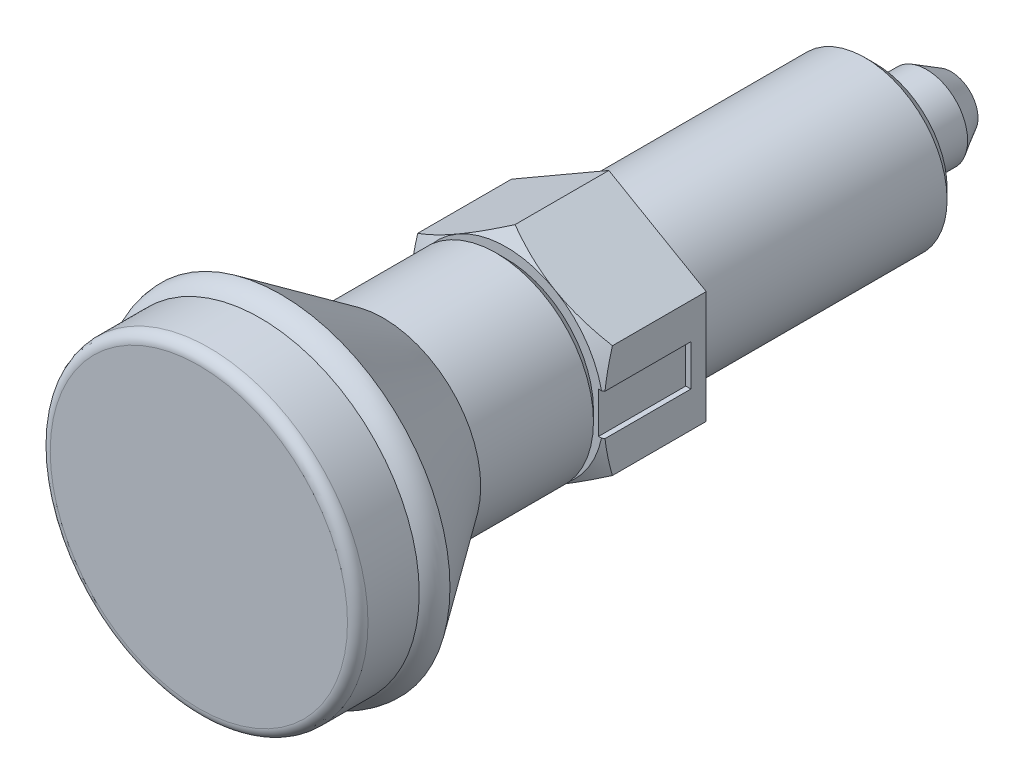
ISO-10303-21;
HEADER;
FILE_DESCRIPTION(('STEP AP214'),'2;1');
FILE_NAME('part.step','',(''),(''),'','','');
FILE_SCHEMA(('AUTOMOTIVE_DESIGN { 1 0 10303 214 1 1 1 1 }'));
ENDSEC;
DATA;
#1=APPLICATION_CONTEXT('core data for automotive mechanical design processes');
#2=APPLICATION_PROTOCOL_DEFINITION('international standard','automotive_design',2000,#1);
#3=PRODUCT_CONTEXT('',#1,'mechanical');
#4=PRODUCT('Part','Part','',(#3));
#5=PRODUCT_RELATED_PRODUCT_CATEGORY('part','',(#4));
#6=PRODUCT_DEFINITION_FORMATION('','',#4);
#7=PRODUCT_DEFINITION_CONTEXT('part definition',#1,'design');
#8=PRODUCT_DEFINITION('design','',#6,#7);
#9=PRODUCT_DEFINITION_SHAPE('','',#8);
#10=(LENGTH_UNIT() NAMED_UNIT(*) SI_UNIT(.MILLI.,.METRE.));
#11=(NAMED_UNIT(*) PLANE_ANGLE_UNIT() SI_UNIT($,.RADIAN.));
#12=(NAMED_UNIT(*) SI_UNIT($,.STERADIAN.) SOLID_ANGLE_UNIT());
#13=UNCERTAINTY_MEASURE_WITH_UNIT(LENGTH_MEASURE(1.E-05),#10,'distance_accuracy_value','');
#14=(GEOMETRIC_REPRESENTATION_CONTEXT(3) GLOBAL_UNCERTAINTY_ASSIGNED_CONTEXT((#13)) GLOBAL_UNIT_ASSIGNED_CONTEXT((#10,
#11,#12)) REPRESENTATION_CONTEXT('',''));
#15=CARTESIAN_POINT('',(0.,0.,0.));
#16=DIRECTION('',(0.,0.,1.));
#17=DIRECTION('',(1.,0.,0.));
#18=AXIS2_PLACEMENT_3D('',#15,#16,#17);
#19=CARTESIAN_POINT('',(0.,0.,10.0000000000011));
#20=DIRECTION('',(0.,0.,-1.));
#21=DIRECTION('',(-1.,0.,0.));
#22=AXIS2_PLACEMENT_3D('',#19,#20,#21);
#23=CONICAL_SURFACE('',#22,9.50000000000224,1.0471975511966);
#24=CARTESIAN_POINT('',(9.5,-14.5465709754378,5.45399629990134));
#25=CARTESIAN_POINT('',(9.5,-14.3380268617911,5.55480343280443));
#26=CARTESIAN_POINT('',(9.5,-14.1292306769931,5.65508884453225));
#27=CARTESIAN_POINT('',(9.5,-13.7110809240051,5.85449646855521));
#28=CARTESIAN_POINT('',(9.5,-13.5017273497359,5.95361866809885));
#29=CARTESIAN_POINT('',(9.5,-12.8726893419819,6.24908954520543));
#30=CARTESIAN_POINT('',(9.5,-12.4520954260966,6.44350963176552));
#31=CARTESIAN_POINT('',(9.5,-11.6055942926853,6.82706422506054));
#32=CARTESIAN_POINT('',(9.5,-11.1796704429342,7.01616211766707));
#33=CARTESIAN_POINT('',(9.5,-10.3243227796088,7.38623890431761));
#34=CARTESIAN_POINT('',(9.5,-9.89489914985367,7.56721822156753));
#35=CARTESIAN_POINT('',(9.5,-9.02653674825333,7.92104245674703));
#36=CARTESIAN_POINT('',(9.5,-8.5875458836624,8.09376023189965));
#37=CARTESIAN_POINT('',(9.5,-7.70438743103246,8.42566892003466));
#38=CARTESIAN_POINT('',(9.5,-7.26021927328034,8.58485832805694));
#39=CARTESIAN_POINT('',(9.5,-6.36690631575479,8.88543197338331));
#40=CARTESIAN_POINT('',(9.5,-5.91777439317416,9.02685406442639));
#41=CARTESIAN_POINT('',(9.5,-5.01314168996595,9.28730255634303));
#42=CARTESIAN_POINT('',(9.5,-4.55764297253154,9.40633603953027));
#43=CARTESIAN_POINT('',(9.5,-3.63988944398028,9.61621987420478));
#44=CARTESIAN_POINT('',(9.5,-3.17763286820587,9.7070627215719));
#45=CARTESIAN_POINT('',(9.5,-2.48018032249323,9.81763543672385));
#46=CARTESIAN_POINT('',(9.5,-2.24698957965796,9.85021348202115));
#47=CARTESIAN_POINT('',(9.5,-1.77951479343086,9.90616471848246));
#48=CARTESIAN_POINT('',(9.5,-1.54523086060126,9.92953882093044));
#49=CARTESIAN_POINT('',(9.5,-1.077372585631,9.9664531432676));
#50=CARTESIAN_POINT('',(9.5,-0.843803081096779,9.98005442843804));
#51=CARTESIAN_POINT('',(9.5,-0.376297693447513,9.99735120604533));
#52=CARTESIAN_POINT('',(9.5,-0.142361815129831,10.0010468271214));
#53=CARTESIAN_POINT('',(9.5,0.325389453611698,9.99844421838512));
#54=CARTESIAN_POINT('',(9.5,0.559204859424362,9.9921487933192));
#55=CARTESIAN_POINT('',(9.5,1.02636653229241,9.9697206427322));
#56=CARTESIAN_POINT('',(9.5,1.25971277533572,9.95358742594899));
#57=CARTESIAN_POINT('',(9.5,1.82527222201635,9.90289987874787));
#58=CARTESIAN_POINT('',(9.5,2.15705089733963,9.86341646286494));
#59=CARTESIAN_POINT('',(9.5,2.8180658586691,9.7667532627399));
#60=CARTESIAN_POINT('',(9.5,3.14730142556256,9.70956864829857));
#61=CARTESIAN_POINT('',(9.5,3.8029585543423,9.5795312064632));
#62=CARTESIAN_POINT('',(9.5,4.12937714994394,9.50666356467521));
#63=CARTESIAN_POINT('',(9.5,4.77885595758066,9.34748334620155));
#64=CARTESIAN_POINT('',(9.5,5.1019164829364,9.26117203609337));
#65=CARTESIAN_POINT('',(9.5,5.75263605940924,9.07491321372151));
#66=CARTESIAN_POINT('',(9.5,6.08021372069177,8.97468330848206));
#67=CARTESIAN_POINT('',(9.5,6.73190653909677,8.76432020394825));
#68=CARTESIAN_POINT('',(9.5,7.05602391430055,8.65419383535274));
#69=CARTESIAN_POINT('',(9.5,7.69949559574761,8.42631257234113));
#70=CARTESIAN_POINT('',(9.5,8.0188664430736,8.30860410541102));
#71=CARTESIAN_POINT('',(9.5,8.65513026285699,8.06627835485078));
#72=CARTESIAN_POINT('',(9.5,8.97202217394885,7.94165827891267));
#73=CARTESIAN_POINT('',(9.5,9.28776285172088,7.81426610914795));
#74=B_SPLINE_CURVE_WITH_KNOTS('',3,(#24,#25,#26,#27,#28,#29,#30,#31,#32,#33,#34,#35,#36,#37,#38,
#39,#40,#41,#42,#43,#44,#45,#46,#47,#48,#49,#50,#51,#52,#53,#54,#55,#56,#57,#58,#59,#60,#61,#62,
#63,#64,#65,#66,#67,#68,#69,#70,#71,#72,#73),.UNSPECIFIED.,.F.,.F.,(4,2,2,2,2,2,2,2,2,2,2,2,2,2,
2,2,2,2,2,2,2,2,2,2,4),(0.,0.694890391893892,1.38978839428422,2.77981043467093,4.17778700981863,
5.57569062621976,6.99075616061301,8.40597890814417,9.81813342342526,11.229840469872,
12.6419229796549,13.3481360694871,14.0542792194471,14.7559707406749,15.4576531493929,
16.1591386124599,16.8606591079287,17.8624602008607,18.8645349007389,19.8675603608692,
20.8704913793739,21.8980064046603,22.9248175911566,23.9458491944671,24.9672963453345),.UNSPECIFIED.);
#75=CARTESIAN_POINT('',(9.5,-5.48482755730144,9.1514942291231));
#76=VERTEX_POINT('',#75);
#77=CARTESIAN_POINT('',(9.5,-2.,9.8797703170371));
#78=VERTEX_POINT('',#77);
#79=EDGE_CURVE('E302',#76,#78,#74,.T.);
#80=ORIENTED_EDGE('',*,*,#79,.T.);
#81=CARTESIAN_POINT('',(11.0778024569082,-2.,8.9856556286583));
#82=CARTESIAN_POINT('',(10.7982173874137,-2.,9.14450071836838));
#83=CARTESIAN_POINT('',(10.5185552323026,-2.,9.30321035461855));
#84=CARTESIAN_POINT('',(9.95902560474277,-2.,9.62026532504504));
#85=CARTESIAN_POINT('',(9.67915813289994,-2.,9.77861066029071));
#86=CARTESIAN_POINT('',(9.11916469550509,-2.,10.0948447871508));
#87=CARTESIAN_POINT('',(8.83903872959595,-2.,10.2527335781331));
#88=CARTESIAN_POINT('',(8.27844051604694,-2.,10.5678970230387));
#89=CARTESIAN_POINT('',(7.9979682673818,-2.,10.7251716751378));
#90=CARTESIAN_POINT('',(7.71727962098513,-2.,10.882060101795));
#91=B_SPLINE_CURVE_WITH_KNOTS('',3,(#81,#82,#83,#84,#85,#86,#87,#88,#89,#90),.UNSPECIFIED.,.F.,
.F.,(4,2,2,2,4),(0.,0.964674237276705,1.9293456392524,2.89401837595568,3.85869397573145),.UNSPECIFIED.);
#92=CARTESIAN_POINT('',(9.28708781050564,-2.,10.0000000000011));
#93=VERTEX_POINT('',#92);
#94=EDGE_CURVE('E146',#78,#93,#91,.T.);
#95=ORIENTED_EDGE('',*,*,#94,.T.);
#96=CARTESIAN_POINT('',(0.,0.,10.0000000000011));
#97=DIRECTION('',(0.,0.,1.));
#98=DIRECTION('',(1.,0.,0.));
#99=AXIS2_PLACEMENT_3D('',#96,#97,#98);
#100=CIRCLE('',#99,9.50000000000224);
#101=CARTESIAN_POINT('',(4.75,-8.22724133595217,10.0000000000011));
#102=VERTEX_POINT('',#101);
#103=EDGE_CURVE('E404',#102,#93,#100,.T.);
#104=ORIENTED_EDGE('',*,*,#103,.F.);
#105=CARTESIAN_POINT('',(-0.000200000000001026,-10.9697705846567,9.1514275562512));
#106=CARTESIAN_POINT('',(0.208630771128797,-10.8492020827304,9.22102656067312));
#107=CARTESIAN_POINT('',(0.418240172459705,-10.7281840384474,9.28746669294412));
#108=CARTESIAN_POINT('',(0.839139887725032,-10.4851774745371,9.41315271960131));
#109=CARTESIAN_POINT('',(1.05043073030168,-10.3631886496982,9.47239624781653));
#110=CARTESIAN_POINT('',(1.68770779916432,-9.99525656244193,9.63818542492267));
#111=CARTESIAN_POINT('',(2.11620976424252,-9.74786083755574,9.73248555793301));
#112=CARTESIAN_POINT('',(2.75744333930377,-9.37764446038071,9.84306129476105));
#113=CARTESIAN_POINT('',(2.96825921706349,-9.25592985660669,9.87456017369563));
#114=CARTESIAN_POINT('',(3.39086703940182,-9.01193711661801,9.92738179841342));
#115=CARTESIAN_POINT('',(3.60265900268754,-8.8896589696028,9.94870434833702));
#116=CARTESIAN_POINT('',(4.02659621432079,-8.64489870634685,9.98062697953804));
#117=CARTESIAN_POINT('',(4.23874074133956,-8.52241700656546,9.99123980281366));
#118=CARTESIAN_POINT('',(4.66322575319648,-8.2773404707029,10.0015174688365));
#119=CARTESIAN_POINT('',(4.87556623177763,-8.15474563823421,10.001182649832));
#120=CARTESIAN_POINT('',(5.27254199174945,-7.92555157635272,9.99032663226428));
#121=CARTESIAN_POINT('',(5.45720529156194,-7.81893617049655,9.98112973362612));
#122=CARTESIAN_POINT('',(5.82610000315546,-7.6059547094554,9.95463460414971));
#123=CARTESIAN_POINT('',(6.01033138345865,-7.49958867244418,9.93733580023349));
#124=CARTESIAN_POINT('',(6.562311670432,-7.18090270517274,9.87369551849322));
#125=CARTESIAN_POINT('',(6.92908353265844,-6.96914687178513,9.81561809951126));
#126=CARTESIAN_POINT('',(7.66651782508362,-6.5433889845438,9.67042398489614));
#127=CARTESIAN_POINT('',(8.03708614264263,-6.32944126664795,9.58269183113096));
#128=CARTESIAN_POINT('',(8.77269671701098,-5.90473630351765,9.38357626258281));
#129=CARTESIAN_POINT('',(9.13774839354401,-5.69397361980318,9.27223961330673));
#130=CARTESIAN_POINT('',(9.5002,-5.4847120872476,9.1514275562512));
#131=B_SPLINE_CURVE_WITH_KNOTS('',3,(#105,#106,#107,#108,#109,#110,#111,#112,#113,#114,#115,
#116,#117,#118,#119,#120,#121,#122,#123,#124,#125,#126,#127,#128,#129,#130),.UNSPECIFIED.,.F.,
.F.,(4,2,2,2,2,2,2,2,2,2,2,2,4),(0.,0.752880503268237,1.50600787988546,3.01546870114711,
3.75167336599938,4.48789219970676,5.22323407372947,5.95855322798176,6.59868084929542,
7.23885375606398,8.52010929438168,9.82978009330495,11.1368800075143),.UNSPECIFIED.);
#132=EDGE_CURVE('E294',#102,#76,#131,.T.);
#133=ORIENTED_EDGE('',*,*,#132,.T.);
#134=EDGE_LOOP('',(#80,#95,#104,#133));
#135=FACE_BOUND('',#134,.T.);
#136=ADVANCED_FACE('F14',(#135),#23,.T.);
#137=CARTESIAN_POINT('',(9.28708781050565,2.,10.0000000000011));
#138=VERTEX_POINT('',#137);
#139=CARTESIAN_POINT('',(4.75,8.22724133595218,10.0000000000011));
#140=VERTEX_POINT('',#139);
#141=EDGE_CURVE('E407',#138,#140,#100,.T.);
#142=ORIENTED_EDGE('',*,*,#141,.F.);
#143=CARTESIAN_POINT('',(7.71727962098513,2.,10.882060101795));
#144=CARTESIAN_POINT('',(7.9979682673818,2.,10.7251716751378));
#145=CARTESIAN_POINT('',(8.27844051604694,2.,10.5678970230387));
#146=CARTESIAN_POINT('',(8.83903872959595,2.,10.2527335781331));
#147=CARTESIAN_POINT('',(9.11916469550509,2.,10.0948447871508));
#148=CARTESIAN_POINT('',(9.67915813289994,2.,9.77861066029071));
#149=CARTESIAN_POINT('',(9.95902560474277,2.,9.62026532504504));
#150=CARTESIAN_POINT('',(10.5185552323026,2.,9.30321035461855));
#151=CARTESIAN_POINT('',(10.7982173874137,2.,9.14450071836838));
#152=CARTESIAN_POINT('',(11.0778024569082,2.,8.9856556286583));
#153=B_SPLINE_CURVE_WITH_KNOTS('',3,(#143,#144,#145,#146,#147,#148,#149,#150,#151,#152),
.UNSPECIFIED.,.F.,.F.,(4,2,2,2,4),(0.,0.964675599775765,1.92934833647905,2.89401973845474,
3.85869397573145),.UNSPECIFIED.);
#154=CARTESIAN_POINT('',(9.5,2.,9.8797703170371));
#155=VERTEX_POINT('',#154);
#156=EDGE_CURVE('E154',#138,#155,#153,.T.);
#157=ORIENTED_EDGE('',*,*,#156,.T.);
#158=CARTESIAN_POINT('',(9.5,5.48482755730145,9.1514942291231));
#159=VERTEX_POINT('',#158);
#160=EDGE_CURVE('E270',#155,#159,#74,.T.);
#161=ORIENTED_EDGE('',*,*,#160,.T.);
#162=CARTESIAN_POINT('',(9.5002,5.48471208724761,9.1514275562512));
#163=CARTESIAN_POINT('',(9.2913692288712,5.6052805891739,9.22102656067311));
#164=CARTESIAN_POINT('',(9.0817598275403,5.72629863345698,9.28746669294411));
#165=CARTESIAN_POINT('',(8.66086011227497,5.96930519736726,9.4131527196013));
#166=CARTESIAN_POINT('',(8.44956926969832,6.09129402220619,9.47239624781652));
#167=CARTESIAN_POINT('',(7.81229220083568,6.45922610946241,9.63818542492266));
#168=CARTESIAN_POINT('',(7.38379023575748,6.70662183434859,9.732485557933));
#169=CARTESIAN_POINT('',(6.74255666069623,7.07683821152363,9.84306129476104));
#170=CARTESIAN_POINT('',(6.53174078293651,7.19855281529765,9.87456017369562));
#171=CARTESIAN_POINT('',(6.10913296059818,7.44254555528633,9.92738179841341));
#172=CARTESIAN_POINT('',(5.89734099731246,7.56482370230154,9.94870434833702));
#173=CARTESIAN_POINT('',(5.47340378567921,7.8095839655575,9.98062697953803));
#174=CARTESIAN_POINT('',(5.26125925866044,7.93206566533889,9.99123980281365));
#175=CARTESIAN_POINT('',(4.83677424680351,8.17714220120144,10.0015174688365));
#176=CARTESIAN_POINT('',(4.62443376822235,8.29973703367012,10.001182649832));
#177=CARTESIAN_POINT('',(4.22745800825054,8.52893109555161,9.99032663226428));
#178=CARTESIAN_POINT('',(4.04279470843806,8.63554650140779,9.98112973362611));
#179=CARTESIAN_POINT('',(3.67389999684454,8.84852796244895,9.9546346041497));
#180=CARTESIAN_POINT('',(3.48966861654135,8.95489399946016,9.93733580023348));
#181=CARTESIAN_POINT('',(2.93768832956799,9.2735799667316,9.87369551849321));
#182=CARTESIAN_POINT('',(2.57091646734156,9.48533580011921,9.81561809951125));
#183=CARTESIAN_POINT('',(1.83348217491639,9.91109368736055,9.67042398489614));
#184=CARTESIAN_POINT('',(1.46291385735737,10.1250414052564,9.58269183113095));
#185=CARTESIAN_POINT('',(0.727303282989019,10.5497463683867,9.3835762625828));
#186=CARTESIAN_POINT('',(0.362251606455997,10.7605090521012,9.27223961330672));
#187=CARTESIAN_POINT('',(-0.000199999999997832,10.9697705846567,9.1514275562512));
#188=B_SPLINE_CURVE_WITH_KNOTS('',3,(#162,#163,#164,#165,#166,#167,#168,#169,#170,#171,#172,
#173,#174,#175,#176,#177,#178,#179,#180,#181,#182,#183,#184,#185,#186,#187),.UNSPECIFIED.,.F.,
.F.,(4,2,2,2,2,2,2,2,2,2,2,2,4),(0.,0.752880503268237,1.50600787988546,3.01546870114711,
3.75167336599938,4.48789219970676,5.22323407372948,5.95855322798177,6.59868084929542,
7.23885375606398,8.52010929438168,9.82978009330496,11.1368800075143),.UNSPECIFIED.);
#189=EDGE_CURVE('E269',#159,#140,#188,.T.);
#190=ORIENTED_EDGE('',*,*,#189,.T.);
#191=EDGE_LOOP('',(#142,#157,#161,#190));
#192=FACE_BOUND('',#191,.T.);
#193=ADVANCED_FACE('F368',(#192),#23,.T.);
#194=CARTESIAN_POINT('',(0.,8.50000000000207,10.0000000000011));
#195=DIRECTION('',(0.,0.,1.));
#196=DIRECTION('',(1.,0.,0.));
#197=AXIS2_PLACEMENT_3D('',#194,#195,#196);
#198=PLANE('',#197);
#199=CARTESIAN_POINT('',(0.,0.,10.0000000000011));
#200=DIRECTION('',(0.,0.,1.));
#201=DIRECTION('',(1.,0.,0.));
#202=AXIS2_PLACEMENT_3D('',#199,#200,#201);
#203=CIRCLE('',#202,8.50000000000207);
#204=CARTESIAN_POINT('',(8.50000000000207,0.,10.0000000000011));
#205=VERTEX_POINT('',#204);
#206=EDGE_CURVE('E417',#205,#205,#203,.T.);
#207=ORIENTED_EDGE('',*,*,#206,.F.);
#208=EDGE_LOOP('',(#207));
#209=FACE_BOUND('',#208,.T.);
#210=ORIENTED_EDGE('',*,*,#103,.T.);
#211=DIRECTION('',(1.,0.,0.));
#212=VECTOR('',#211,1.);
#213=CARTESIAN_POINT('',(9.,-2.,10.0000000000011));
#214=LINE('',#213,#212);
#215=CARTESIAN_POINT('',(9.,-2.,10.0000000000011));
#216=VERTEX_POINT('',#215);
#217=EDGE_CURVE('E155',#216,#93,#214,.T.);
#218=ORIENTED_EDGE('',*,*,#217,.F.);
#219=DIRECTION('',(0.,1.,0.));
#220=VECTOR('',#219,1.);
#221=CARTESIAN_POINT('',(9.,-2.,10.0000000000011));
#222=LINE('',#221,#220);
#223=CARTESIAN_POINT('',(9.,2.,10.0000000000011));
#224=VERTEX_POINT('',#223);
#225=EDGE_CURVE('E164',#216,#224,#222,.T.);
#226=ORIENTED_EDGE('',*,*,#225,.T.);
#227=DIRECTION('',(1.,0.,0.));
#228=VECTOR('',#227,1.);
#229=CARTESIAN_POINT('',(9.,2.,10.0000000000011));
#230=LINE('',#229,#228);
#231=EDGE_CURVE('E171',#224,#138,#230,.T.);
#232=ORIENTED_EDGE('',*,*,#231,.T.);
#233=ORIENTED_EDGE('',*,*,#141,.T.);
#234=CARTESIAN_POINT('',(-4.75,8.22724133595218,10.0000000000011));
#235=VERTEX_POINT('',#234);
#236=EDGE_CURVE('E412',#140,#235,#100,.T.);
#237=ORIENTED_EDGE('',*,*,#236,.T.);
#238=CARTESIAN_POINT('',(-9.28708781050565,2.,10.0000000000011));
#239=VERTEX_POINT('',#238);
#240=EDGE_CURVE('E406',#235,#239,#100,.T.);
#241=ORIENTED_EDGE('',*,*,#240,.T.);
#242=DIRECTION('',(-1.,0.,0.));
#243=VECTOR('',#242,1.);
#244=CARTESIAN_POINT('',(-9.,2.,10.0000000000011));
#245=LINE('',#244,#243);
#246=CARTESIAN_POINT('',(-9.,2.,10.0000000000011));
#247=VERTEX_POINT('',#246);
#248=EDGE_CURVE('E450',#247,#239,#245,.T.);
#249=ORIENTED_EDGE('',*,*,#248,.F.);
#250=DIRECTION('',(0.,1.,0.));
#251=VECTOR('',#250,1.);
#252=CARTESIAN_POINT('',(-9.,-2.,10.0000000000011));
#253=LINE('',#252,#251);
#254=CARTESIAN_POINT('',(-9.,-2.,10.0000000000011));
#255=VERTEX_POINT('',#254);
#256=EDGE_CURVE('E461',#255,#247,#253,.T.);
#257=ORIENTED_EDGE('',*,*,#256,.F.);
#258=DIRECTION('',(-1.,0.,0.));
#259=VECTOR('',#258,1.);
#260=CARTESIAN_POINT('',(-9.,-2.,10.0000000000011));
#261=LINE('',#260,#259);
#262=CARTESIAN_POINT('',(-9.28708781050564,-2.,10.0000000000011));
#263=VERTEX_POINT('',#262);
#264=EDGE_CURVE('E467',#255,#263,#261,.T.);
#265=ORIENTED_EDGE('',*,*,#264,.T.);
#266=CARTESIAN_POINT('',(-4.75,-8.22724133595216,10.0000000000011));
#267=VERTEX_POINT('',#266);
#268=EDGE_CURVE('E403',#263,#267,#100,.T.);
#269=ORIENTED_EDGE('',*,*,#268,.T.);
#270=EDGE_CURVE('E398',#267,#102,#100,.T.);
#271=ORIENTED_EDGE('',*,*,#270,.T.);
#272=EDGE_LOOP('',(#210,#218,#226,#232,#233,#237,#241,#249,#257,#265,#269,#271));
#273=FACE_BOUND('',#272,.T.);
#274=ADVANCED_FACE('F286',(#209,#273),#198,.T.);
#275=CARTESIAN_POINT('',(9.5,5.48482755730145,39.022979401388));
#276=DIRECTION('',(1.,0.,0.));
#277=DIRECTION('',(0.,1.,0.));
#278=AXIS2_PLACEMENT_3D('',#275,#276,#277);
#279=PLANE('',#278);
#280=DIRECTION('',(0.,-1.,0.));
#281=VECTOR('',#280,1.);
#282=CARTESIAN_POINT('',(9.5,2.,1.5000000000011));
#283=LINE('',#282,#281);
#284=CARTESIAN_POINT('',(9.5,2.,1.5000000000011));
#285=VERTEX_POINT('',#284);
#286=CARTESIAN_POINT('',(9.5,-2.,1.5000000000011));
#287=VERTEX_POINT('',#286);
#288=EDGE_CURVE('E29',#285,#287,#283,.T.);
#289=ORIENTED_EDGE('',*,*,#288,.T.);
#290=DIRECTION('',(0.,0.,1.));
#291=VECTOR('',#290,1.);
#292=CARTESIAN_POINT('',(9.5,-2.,1.5000000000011));
#293=LINE('',#292,#291);
#294=EDGE_CURVE('E142',#287,#78,#293,.T.);
#295=ORIENTED_EDGE('',*,*,#294,.T.);
#296=ORIENTED_EDGE('',*,*,#79,.F.);
#297=DIRECTION('',(0.,0.,-1.));
#298=VECTOR('',#297,1.);
#299=CARTESIAN_POINT('',(9.5,-5.48482755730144,39.022979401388));
#300=LINE('',#299,#298);
#301=CARTESIAN_POINT('',(9.5,-5.48482755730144,0.));
#302=VERTEX_POINT('',#301);
#303=EDGE_CURVE('E239',#76,#302,#300,.T.);
#304=ORIENTED_EDGE('',*,*,#303,.T.);
#305=DIRECTION('',(0.,-1.,0.));
#306=VECTOR('',#305,1.);
#307=CARTESIAN_POINT('',(9.5,5.48482755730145,0.));
#308=LINE('',#307,#306);
#309=CARTESIAN_POINT('',(9.49999998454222,5.48482756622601,0.));
#310=VERTEX_POINT('',#309);
#311=EDGE_CURVE('E244',#310,#302,#308,.T.);
#312=ORIENTED_EDGE('',*,*,#311,.F.);
#313=DIRECTION('',(0.,0.,-1.));
#314=VECTOR('',#313,1.);
#315=CARTESIAN_POINT('',(9.5,5.48482755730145,39.022979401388));
#316=LINE('',#315,#314);
#317=EDGE_CURVE('E243',#159,#310,#316,.T.);
#318=ORIENTED_EDGE('',*,*,#317,.F.);
#319=ORIENTED_EDGE('',*,*,#160,.F.);
#320=DIRECTION('',(0.,0.,-1.));
#321=VECTOR('',#320,1.);
#322=CARTESIAN_POINT('',(9.5,2.,39.022979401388));
#323=LINE('',#322,#321);
#324=EDGE_CURVE('E9',#155,#285,#323,.T.);
#325=ORIENTED_EDGE('',*,*,#324,.T.);
#326=EDGE_LOOP('',(#289,#295,#296,#304,#312,#318,#319,#325));
#327=FACE_BOUND('',#326,.T.);
#328=ADVANCED_FACE('F157',(#327),#279,.T.);
#329=CARTESIAN_POINT('',(1.54577869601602E-08,10.9696551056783,9.1514942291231));
#330=VERTEX_POINT('',#329);
#331=EDGE_CURVE('E251',#140,#330,#188,.T.);
#332=ORIENTED_EDGE('',*,*,#331,.T.);
#333=CARTESIAN_POINT('',(0.000200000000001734,10.9697705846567,9.1514275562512));
#334=CARTESIAN_POINT('',(-0.208630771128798,10.8492020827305,9.22102656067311));
#335=CARTESIAN_POINT('',(-0.418240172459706,10.7281840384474,9.28746669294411));
#336=CARTESIAN_POINT('',(-0.839139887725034,10.4851774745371,9.4131527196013));
#337=CARTESIAN_POINT('',(-1.05043073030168,10.3631886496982,9.47239624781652));
#338=CARTESIAN_POINT('',(-1.68770779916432,9.99525656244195,9.63818542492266));
#339=CARTESIAN_POINT('',(-2.11620976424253,9.74786083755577,9.73248555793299));
#340=CARTESIAN_POINT('',(-2.75744333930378,9.37764446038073,9.84306129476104));
#341=CARTESIAN_POINT('',(-2.96825921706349,9.25592985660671,9.87456017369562));
#342=CARTESIAN_POINT('',(-3.39086703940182,9.01193711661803,9.92738179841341));
#343=CARTESIAN_POINT('',(-3.60265900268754,8.88965896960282,9.94870434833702));
#344=CARTESIAN_POINT('',(-4.0265962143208,8.64489870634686,9.98062697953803));
#345=CARTESIAN_POINT('',(-4.23874074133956,8.52241700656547,9.99123980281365));
#346=CARTESIAN_POINT('',(-4.66322575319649,8.27734047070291,10.0015174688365));
#347=CARTESIAN_POINT('',(-4.87556623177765,8.15474563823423,10.001182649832));
#348=CARTESIAN_POINT('',(-5.27254199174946,7.92555157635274,9.99032663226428));
#349=CARTESIAN_POINT('',(-5.45720529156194,7.81893617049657,9.98112973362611));
#350=CARTESIAN_POINT('',(-5.82610000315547,7.60595470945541,9.9546346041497));
#351=CARTESIAN_POINT('',(-6.01033138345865,7.4995886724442,9.93733580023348));
#352=CARTESIAN_POINT('',(-6.56231167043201,7.18090270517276,9.87369551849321));
#353=CARTESIAN_POINT('',(-6.92908353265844,6.96914687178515,9.81561809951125));
#354=CARTESIAN_POINT('',(-7.66651782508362,6.54338898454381,9.67042398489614));
#355=CARTESIAN_POINT('',(-8.03708614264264,6.32944126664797,9.58269183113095));
#356=CARTESIAN_POINT('',(-8.77269671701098,5.90473630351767,9.3835762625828));
#357=CARTESIAN_POINT('',(-9.13774839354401,5.6939736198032,9.27223961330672));
#358=CARTESIAN_POINT('',(-9.5002,5.48471208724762,9.1514275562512));
#359=B_SPLINE_CURVE_WITH_KNOTS('',3,(#333,#334,#335,#336,#337,#338,#339,#340,#341,#342,#343,
#344,#345,#346,#347,#348,#349,#350,#351,#352,#353,#354,#355,#356,#357,#358),.UNSPECIFIED.,.F.,
.F.,(4,2,2,2,2,2,2,2,2,2,2,2,4),(0.,0.752880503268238,1.50600787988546,3.01546870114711,
3.75167336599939,4.48789219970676,5.22323407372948,5.95855322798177,6.59868084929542,
7.23885375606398,8.52010929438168,9.82978009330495,11.1368800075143),.UNSPECIFIED.);
#360=EDGE_CURVE('E494',#330,#235,#359,.T.);
#361=ORIENTED_EDGE('',*,*,#360,.T.);
#362=ORIENTED_EDGE('',*,*,#236,.F.);
#363=EDGE_LOOP('',(#332,#361,#362));
#364=FACE_BOUND('',#363,.T.);
#365=ADVANCED_FACE('F189',(#364),#23,.T.);
#366=CARTESIAN_POINT('',(-7.71727962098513,2.,10.882060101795));
#367=CARTESIAN_POINT('',(-7.9979682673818,2.,10.7251716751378));
#368=CARTESIAN_POINT('',(-8.27844051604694,2.,10.5678970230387));
#369=CARTESIAN_POINT('',(-8.83903872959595,2.,10.2527335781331));
#370=CARTESIAN_POINT('',(-9.11916469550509,2.,10.0948447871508));
#371=CARTESIAN_POINT('',(-9.67915813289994,2.,9.77861066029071));
#372=CARTESIAN_POINT('',(-9.95902560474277,2.,9.62026532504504));
#373=CARTESIAN_POINT('',(-10.5185552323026,2.,9.30321035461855));
#374=CARTESIAN_POINT('',(-10.7982173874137,2.,9.14450071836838));
#375=CARTESIAN_POINT('',(-11.0778024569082,2.,8.9856556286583));
#376=B_SPLINE_CURVE_WITH_KNOTS('',3,(#366,#367,#368,#369,#370,#371,#372,#373,#374,#375),
.UNSPECIFIED.,.F.,.F.,(4,2,2,2,4),(0.,0.964675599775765,1.92934833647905,2.89401973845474,
3.85869397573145),.UNSPECIFIED.);
#377=CARTESIAN_POINT('',(-9.5,2.,9.8797703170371));
#378=VERTEX_POINT('',#377);
#379=EDGE_CURVE('E217',#239,#378,#376,.T.);
#380=ORIENTED_EDGE('',*,*,#379,.F.);
#381=ORIENTED_EDGE('',*,*,#240,.F.);
#382=CARTESIAN_POINT('',(-9.5,5.48482755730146,9.1514942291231));
#383=VERTEX_POINT('',#382);
#384=EDGE_CURVE('E318',#235,#383,#359,.T.);
#385=ORIENTED_EDGE('',*,*,#384,.T.);
#386=CARTESIAN_POINT('',(-9.5,-14.5465709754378,5.45399629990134));
#387=CARTESIAN_POINT('',(-9.5,-14.3380268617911,5.55480343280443));
#388=CARTESIAN_POINT('',(-9.5,-14.129230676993,5.65508884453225));
#389=CARTESIAN_POINT('',(-9.5,-13.7110809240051,5.85449646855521));
#390=CARTESIAN_POINT('',(-9.5,-13.5017273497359,5.95361866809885));
#391=CARTESIAN_POINT('',(-9.5,-12.8726893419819,6.24908954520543));
#392=CARTESIAN_POINT('',(-9.5,-12.4520954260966,6.44350963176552));
#393=CARTESIAN_POINT('',(-9.5,-11.6055942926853,6.82706422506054));
#394=CARTESIAN_POINT('',(-9.5,-11.1796704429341,7.01616211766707));
#395=CARTESIAN_POINT('',(-9.5,-10.3243227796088,7.38623890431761));
#396=CARTESIAN_POINT('',(-9.5,-9.89489914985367,7.56721822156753));
#397=CARTESIAN_POINT('',(-9.5,-9.02653674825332,7.92104245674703));
#398=CARTESIAN_POINT('',(-9.5,-8.58754588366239,8.09376023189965));
#399=CARTESIAN_POINT('',(-9.5,-7.70438743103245,8.42566892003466));
#400=CARTESIAN_POINT('',(-9.5,-7.26021927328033,8.58485832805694));
#401=CARTESIAN_POINT('',(-9.5,-6.36690631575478,8.88543197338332));
#402=CARTESIAN_POINT('',(-9.5,-5.91777439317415,9.0268540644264));
#403=CARTESIAN_POINT('',(-9.5,-5.01314168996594,9.28730255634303));
#404=CARTESIAN_POINT('',(-9.5,-4.55764297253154,9.40633603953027));
#405=CARTESIAN_POINT('',(-9.5,-3.63988944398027,9.61621987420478));
#406=CARTESIAN_POINT('',(-9.5,-3.17763286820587,9.7070627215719));
#407=CARTESIAN_POINT('',(-9.5,-2.48018032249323,9.81763543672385));
#408=CARTESIAN_POINT('',(-9.5,-2.24698957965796,9.85021348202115));
#409=CARTESIAN_POINT('',(-9.5,-1.77951479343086,9.90616471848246));
#410=CARTESIAN_POINT('',(-9.5,-1.54523086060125,9.92953882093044));
#411=CARTESIAN_POINT('',(-9.5,-1.077372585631,9.9664531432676));
#412=CARTESIAN_POINT('',(-9.5,-0.843803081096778,9.98005442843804));
#413=CARTESIAN_POINT('',(-9.5,-0.376297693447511,9.99735120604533));
#414=CARTESIAN_POINT('',(-9.5,-0.14236181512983,10.0010468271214));
#415=CARTESIAN_POINT('',(-9.5,0.325389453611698,9.99844421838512));
#416=CARTESIAN_POINT('',(-9.5,0.559204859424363,9.9921487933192));
#417=CARTESIAN_POINT('',(-9.5,1.02636653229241,9.9697206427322));
#418=CARTESIAN_POINT('',(-9.5,1.25971277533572,9.95358742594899));
#419=CARTESIAN_POINT('',(-9.5,1.82527222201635,9.90289987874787));
#420=CARTESIAN_POINT('',(-9.5,2.15705089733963,9.86341646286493));
#421=CARTESIAN_POINT('',(-9.5,2.8180658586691,9.7667532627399));
#422=CARTESIAN_POINT('',(-9.5,3.14730142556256,9.70956864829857));
#423=CARTESIAN_POINT('',(-9.5,3.8029585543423,9.5795312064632));
#424=CARTESIAN_POINT('',(-9.5,4.12937714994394,9.5066635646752));
#425=CARTESIAN_POINT('',(-9.5,4.77885595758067,9.34748334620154));
#426=CARTESIAN_POINT('',(-9.5,5.1019164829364,9.26117203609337));
#427=CARTESIAN_POINT('',(-9.5,5.75263605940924,9.07491321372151));
#428=CARTESIAN_POINT('',(-9.5,6.08021372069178,8.97468330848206));
#429=CARTESIAN_POINT('',(-9.5,6.73190653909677,8.76432020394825));
#430=CARTESIAN_POINT('',(-9.5,7.05602391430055,8.65419383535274));
#431=CARTESIAN_POINT('',(-9.5,7.69949559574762,8.42631257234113));
#432=CARTESIAN_POINT('',(-9.5,8.0188664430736,8.30860410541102));
#433=CARTESIAN_POINT('',(-9.5,8.65513026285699,8.06627835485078));
#434=CARTESIAN_POINT('',(-9.5,8.97202217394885,7.94165827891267));
#435=CARTESIAN_POINT('',(-9.5,9.28776285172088,7.81426610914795));
#436=B_SPLINE_CURVE_WITH_KNOTS('',3,(#386,#387,#388,#389,#390,#391,#392,#393,#394,#395,#396,
#397,#398,#399,#400,#401,#402,#403,#404,#405,#406,#407,#408,#409,#410,#411,#412,#413,#414,#415,
#416,#417,#418,#419,#420,#421,#422,#423,#424,#425,#426,#427,#428,#429,#430,#431,#432,#433,#434,
#435),.UNSPECIFIED.,.F.,.F.,(4,2,2,2,2,2,2,2,2,2,2,2,2,2,2,2,2,2,2,2,2,2,2,2,4),(0.,
0.694890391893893,1.38978839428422,2.77981043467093,4.17778700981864,5.57569062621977,
6.99075616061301,8.40597890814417,9.81813342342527,11.229840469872,12.6419229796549,
13.3481360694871,14.0542792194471,14.7559707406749,15.4576531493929,16.1591386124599,
16.8606591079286,17.8624602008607,18.8645349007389,19.8675603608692,20.8704913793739,
21.8980064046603,22.9248175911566,23.945849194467,24.9672963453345),.UNSPECIFIED.);
#437=EDGE_CURVE('E317',#383,#378,#436,.F.);
#438=ORIENTED_EDGE('',*,*,#437,.T.);
#439=EDGE_LOOP('',(#380,#381,#385,#438));
#440=FACE_BOUND('',#439,.T.);
#441=ADVANCED_FACE('F375',(#440),#23,.T.);
#442=CARTESIAN_POINT('',(-11.0778024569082,-2.,8.9856556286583));
#443=CARTESIAN_POINT('',(-10.7982173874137,-2.,9.14450071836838));
#444=CARTESIAN_POINT('',(-10.5185552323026,-2.,9.30321035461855));
#445=CARTESIAN_POINT('',(-9.95902560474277,-2.,9.62026532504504));
#446=CARTESIAN_POINT('',(-9.67915813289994,-2.,9.77861066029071));
#447=CARTESIAN_POINT('',(-9.11916469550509,-2.,10.0948447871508));
#448=CARTESIAN_POINT('',(-8.83903872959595,-2.,10.2527335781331));
#449=CARTESIAN_POINT('',(-8.27844051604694,-2.,10.5678970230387));
#450=CARTESIAN_POINT('',(-7.9979682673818,-2.,10.7251716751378));
#451=CARTESIAN_POINT('',(-7.71727962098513,-2.,10.882060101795));
#452=B_SPLINE_CURVE_WITH_KNOTS('',3,(#442,#443,#444,#445,#446,#447,#448,#449,#450,#451),
.UNSPECIFIED.,.F.,.F.,(4,2,2,2,4),(0.,0.964674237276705,1.9293456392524,2.89401837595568,
3.85869397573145),.UNSPECIFIED.);
#453=CARTESIAN_POINT('',(-9.5,-2.,9.8797703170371));
#454=VERTEX_POINT('',#453);
#455=EDGE_CURVE('E225',#454,#263,#452,.T.);
#456=ORIENTED_EDGE('',*,*,#455,.F.);
#457=CARTESIAN_POINT('',(-9.5,-5.48482755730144,9.1514942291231));
#458=VERTEX_POINT('',#457);
#459=EDGE_CURVE('E311',#454,#458,#436,.F.);
#460=ORIENTED_EDGE('',*,*,#459,.T.);
#461=CARTESIAN_POINT('',(-9.5002,-5.4847120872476,9.1514275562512));
#462=CARTESIAN_POINT('',(-9.2913692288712,-5.60528058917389,9.22102656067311));
#463=CARTESIAN_POINT('',(-9.0817598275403,-5.72629863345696,9.28746669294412));
#464=CARTESIAN_POINT('',(-8.66086011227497,-5.96930519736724,9.41315271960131));
#465=CARTESIAN_POINT('',(-8.44956926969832,-6.09129402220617,9.47239624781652));
#466=CARTESIAN_POINT('',(-7.81229220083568,-6.45922610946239,9.63818542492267));
#467=CARTESIAN_POINT('',(-7.38379023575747,-6.70662183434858,9.73248555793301));
#468=CARTESIAN_POINT('',(-6.74255666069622,-7.07683821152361,9.84306129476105));
#469=CARTESIAN_POINT('',(-6.53174078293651,-7.19855281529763,9.87456017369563));
#470=CARTESIAN_POINT('',(-6.10913296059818,-7.44254555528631,9.92738179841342));
#471=CARTESIAN_POINT('',(-5.89734099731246,-7.56482370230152,9.94870434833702));
#472=CARTESIAN_POINT('',(-5.47340378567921,-7.80958396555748,9.98062697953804));
#473=CARTESIAN_POINT('',(-5.26125925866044,-7.93206566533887,9.99123980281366));
#474=CARTESIAN_POINT('',(-4.83677424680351,-8.17714220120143,10.0015174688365));
#475=CARTESIAN_POINT('',(-4.62443376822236,-8.29973703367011,10.001182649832));
#476=CARTESIAN_POINT('',(-4.22745800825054,-8.5289310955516,9.99032663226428));
#477=CARTESIAN_POINT('',(-4.04279470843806,-8.63554650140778,9.98112973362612));
#478=CARTESIAN_POINT('',(-3.67389999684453,-8.84852796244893,9.95463460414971));
#479=CARTESIAN_POINT('',(-3.48966861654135,-8.95489399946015,9.93733580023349));
#480=CARTESIAN_POINT('',(-2.93768832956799,-9.27357996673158,9.87369551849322));
#481=CARTESIAN_POINT('',(-2.57091646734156,-9.48533580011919,9.81561809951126));
#482=CARTESIAN_POINT('',(-1.83348217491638,-9.91109368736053,9.67042398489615));
#483=CARTESIAN_POINT('',(-1.46291385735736,-10.1250414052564,9.58269183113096));
#484=CARTESIAN_POINT('',(-0.727303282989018,-10.5497463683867,9.38357626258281));
#485=CARTESIAN_POINT('',(-0.362251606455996,-10.7605090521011,9.27223961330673));
#486=CARTESIAN_POINT('',(0.000199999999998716,-10.9697705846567,9.1514275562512));
#487=B_SPLINE_CURVE_WITH_KNOTS('',3,(#461,#462,#463,#464,#465,#466,#467,#468,#469,#470,#471,
#472,#473,#474,#475,#476,#477,#478,#479,#480,#481,#482,#483,#484,#485,#486),.UNSPECIFIED.,.F.,
.F.,(4,2,2,2,2,2,2,2,2,2,2,2,4),(0.,0.752880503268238,1.50600787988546,3.01546870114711,
3.75167336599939,4.48789219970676,5.22323407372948,5.95855322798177,6.59868084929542,
7.23885375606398,8.52010929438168,9.82978009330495,11.1368800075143),.UNSPECIFIED.);
#488=EDGE_CURVE('E310',#458,#267,#487,.T.);
#489=ORIENTED_EDGE('',*,*,#488,.T.);
#490=ORIENTED_EDGE('',*,*,#268,.F.);
#491=EDGE_LOOP('',(#456,#460,#489,#490));
#492=FACE_BOUND('',#491,.T.);
#493=ADVANCED_FACE('F383',(#492),#23,.T.);
#494=ORIENTED_EDGE('',*,*,#270,.F.);
#495=CARTESIAN_POINT('',(0.,-10.9696551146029,9.1514942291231));
#496=VERTEX_POINT('',#495);
#497=EDGE_CURVE('E303',#267,#496,#487,.T.);
#498=ORIENTED_EDGE('',*,*,#497,.T.);
#499=EDGE_CURVE('E301',#496,#102,#131,.T.);
#500=ORIENTED_EDGE('',*,*,#499,.T.);
#501=EDGE_LOOP('',(#494,#498,#500));
#502=FACE_BOUND('',#501,.T.);
#503=ADVANCED_FACE('F378',(#502),#23,.T.);
#504=CARTESIAN_POINT('',(0.,0.,39.9999999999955));
#505=DIRECTION('',(0.,0.,1.));
#506=DIRECTION('',(1.,0.,0.));
#507=AXIS2_PLACEMENT_3D('',#504,#505,#506);
#508=PLANE('',#507);
#509=CARTESIAN_POINT('',(0.,0.,39.9999999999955));
#510=DIRECTION('',(0.,0.,1.));
#511=DIRECTION('',(1.,0.,0.));
#512=AXIS2_PLACEMENT_3D('',#509,#510,#511);
#513=CIRCLE('',#512,14.5);
#514=CARTESIAN_POINT('',(14.5,0.,39.9999999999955));
#515=VERTEX_POINT('',#514);
#516=EDGE_CURVE('E439',#515,#515,#513,.T.);
#517=ORIENTED_EDGE('',*,*,#516,.T.);
#518=EDGE_LOOP('',(#517));
#519=FACE_BOUND('',#518,.T.);
#520=ADVANCED_FACE('F16',(#519),#508,.T.);
#521=CARTESIAN_POINT('',(0.,0.,38.9999999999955));
#522=DIRECTION('',(0.,0.,1.));
#523=DIRECTION('',(1.,0.,0.));
#524=AXIS2_PLACEMENT_3D('',#521,#522,#523);
#525=TOROIDAL_SURFACE('',#524,14.5,1.);
#526=CARTESIAN_POINT('',(0.,0.,39.));
#527=DIRECTION('',(0.,0.,1.));
#528=DIRECTION('',(1.,0.,0.));
#529=AXIS2_PLACEMENT_3D('',#526,#527,#528);
#530=CIRCLE('',#529,15.5);
#531=CARTESIAN_POINT('',(15.5,0.,39.));
#532=VERTEX_POINT('',#531);
#533=EDGE_CURVE('E436',#532,#532,#530,.T.);
#534=ORIENTED_EDGE('',*,*,#533,.T.);
#535=EDGE_LOOP('',(#534));
#536=FACE_BOUND('',#535,.T.);
#537=ORIENTED_EDGE('',*,*,#516,.F.);
#538=EDGE_LOOP('',(#537));
#539=FACE_BOUND('',#538,.T.);
#540=ADVANCED_FACE('F392',(#536,#539),#525,.T.);
#541=CARTESIAN_POINT('',(0.,0.,39.9999999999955));
#542=DIRECTION('',(0.,0.,1.));
#543=DIRECTION('',(1.,0.,0.));
#544=AXIS2_PLACEMENT_3D('',#541,#542,#543);
#545=CYLINDRICAL_SURFACE('',#544,15.5);
#546=CARTESIAN_POINT('',(0.,0.,34.));
#547=DIRECTION('',(0.,0.,1.));
#548=DIRECTION('',(1.,0.,0.));
#549=AXIS2_PLACEMENT_3D('',#546,#547,#548);
#550=CIRCLE('',#549,15.5);
#551=CARTESIAN_POINT('',(15.5,0.,34.));
#552=VERTEX_POINT('',#551);
#553=EDGE_CURVE('E433',#552,#552,#550,.T.);
#554=ORIENTED_EDGE('',*,*,#553,.T.);
#555=EDGE_LOOP('',(#554));
#556=FACE_BOUND('',#555,.T.);
#557=ORIENTED_EDGE('',*,*,#533,.F.);
#558=EDGE_LOOP('',(#557));
#559=FACE_BOUND('',#558,.T.);
#560=ADVANCED_FACE('F620',(#556,#559),#545,.T.);
#561=CARTESIAN_POINT('',(0.,0.,32.0000000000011));
#562=DIRECTION('',(0.,0.,1.));
#563=DIRECTION('',(1.,0.,0.));
#564=AXIS2_PLACEMENT_3D('',#561,#562,#563);
#565=TOROIDAL_SURFACE('',#564,14.0000000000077,2.4999999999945);
#566=CARTESIAN_POINT('',(0.,0.,32.0000000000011));
#567=DIRECTION('',(0.,0.,1.));
#568=DIRECTION('',(1.,0.,0.));
#569=AXIS2_PLACEMENT_3D('',#566,#567,#568);
#570=CIRCLE('',#569,16.5000000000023);
#571=CARTESIAN_POINT('',(16.5000000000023,0.,32.0000000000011));
#572=VERTEX_POINT('',#571);
#573=EDGE_CURVE('E430',#572,#572,#570,.T.);
#574=ORIENTED_EDGE('',*,*,#573,.T.);
#575=EDGE_LOOP('',(#574));
#576=FACE_BOUND('',#575,.T.);
#577=ORIENTED_EDGE('',*,*,#553,.F.);
#578=EDGE_LOOP('',(#577));
#579=FACE_BOUND('',#578,.T.);
#580=ADVANCED_FACE('F628',(#576,#579),#565,.T.);
#581=CARTESIAN_POINT('',(0.,0.,32.0000000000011));
#582=DIRECTION('',(0.,0.,1.));
#583=DIRECTION('',(1.,0.,0.));
#584=AXIS2_PLACEMENT_3D('',#581,#582,#583);
#585=CONICAL_SURFACE('',#584,16.5000000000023,0.610725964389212);
#586=CARTESIAN_POINT('',(0.,0.,22.0000000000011));
#587=DIRECTION('',(0.,0.,1.));
#588=DIRECTION('',(1.,0.,0.));
#589=AXIS2_PLACEMENT_3D('',#586,#587,#588);
#590=CIRCLE('',#589,9.50000000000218);
#591=CARTESIAN_POINT('',(9.50000000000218,0.,22.0000000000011));
#592=VERTEX_POINT('',#591);
#593=EDGE_CURVE('E425',#592,#592,#590,.T.);
#594=ORIENTED_EDGE('',*,*,#593,.T.);
#595=EDGE_LOOP('',(#594));
#596=FACE_BOUND('',#595,.T.);
#597=ORIENTED_EDGE('',*,*,#573,.F.);
#598=EDGE_LOOP('',(#597));
#599=FACE_BOUND('',#598,.T.);
#600=ADVANCED_FACE('F637',(#596,#599),#585,.T.);
#601=CARTESIAN_POINT('',(0.,0.,39.9999999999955));
#602=DIRECTION('',(0.,0.,1.));
#603=DIRECTION('',(1.,0.,0.));
#604=AXIS2_PLACEMENT_3D('',#601,#602,#603);
#605=CYLINDRICAL_SURFACE('',#604,9.50000000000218);
#606=CARTESIAN_POINT('',(0.,0.,11.0000000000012));
#607=DIRECTION('',(0.,0.,1.));
#608=DIRECTION('',(1.,0.,0.));
#609=AXIS2_PLACEMENT_3D('',#606,#607,#608);
#610=CIRCLE('',#609,9.50000000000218);
#611=CARTESIAN_POINT('',(9.50000000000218,0.,11.0000000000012));
#612=VERTEX_POINT('',#611);
#613=EDGE_CURVE('E421',#612,#612,#610,.T.);
#614=ORIENTED_EDGE('',*,*,#613,.T.);
#615=EDGE_LOOP('',(#614));
#616=FACE_BOUND('',#615,.T.);
#617=ORIENTED_EDGE('',*,*,#593,.F.);
#618=EDGE_LOOP('',(#617));
#619=FACE_BOUND('',#618,.T.);
#620=ADVANCED_FACE('F646',(#616,#619),#605,.T.);
#621=CARTESIAN_POINT('',(0.,0.,11.0000000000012));
#622=DIRECTION('',(0.,0.,1.));
#623=DIRECTION('',(1.,0.,0.));
#624=AXIS2_PLACEMENT_3D('',#621,#622,#623);
#625=CONICAL_SURFACE('',#624,9.50000000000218,0.785398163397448);
#626=ORIENTED_EDGE('',*,*,#206,.T.);
#627=EDGE_LOOP('',(#626));
#628=FACE_BOUND('',#627,.T.);
#629=ORIENTED_EDGE('',*,*,#613,.F.);
#630=EDGE_LOOP('',(#629));
#631=FACE_BOUND('',#630,.T.);
#632=ADVANCED_FACE('F333',(#628,#631),#625,.T.);
#633=CARTESIAN_POINT('',(-9.5,5.48482755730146,39.022979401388));
#634=DIRECTION('',(-0.5,0.866025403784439,0.));
#635=DIRECTION('',(-0.866025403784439,-0.5,0.));
#636=AXIS2_PLACEMENT_3D('',#633,#634,#635);
#637=PLANE('',#636);
#638=DIRECTION('',(0.,0.,-1.));
#639=VECTOR('',#638,1.);
#640=CARTESIAN_POINT('',(0.,10.9696551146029,39.022979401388));
#641=LINE('',#640,#639);
#642=CARTESIAN_POINT('',(0.,10.9696551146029,0.));
#643=VERTEX_POINT('',#642);
#644=EDGE_CURVE('E247',#330,#643,#641,.T.);
#645=ORIENTED_EDGE('',*,*,#644,.T.);
#646=DIRECTION('',(0.866025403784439,0.5,0.));
#647=VECTOR('',#646,1.);
#648=CARTESIAN_POINT('',(-9.5,5.48482755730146,0.));
#649=LINE('',#648,#647);
#650=CARTESIAN_POINT('',(-9.5,5.48482755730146,0.));
#651=VERTEX_POINT('',#650);
#652=EDGE_CURVE('E252',#651,#643,#649,.T.);
#653=ORIENTED_EDGE('',*,*,#652,.F.);
#654=DIRECTION('',(0.,0.,-1.));
#655=VECTOR('',#654,1.);
#656=CARTESIAN_POINT('',(-9.5,5.48482755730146,39.022979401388));
#657=LINE('',#656,#655);
#658=EDGE_CURVE('E224',#383,#651,#657,.T.);
#659=ORIENTED_EDGE('',*,*,#658,.F.);
#660=ORIENTED_EDGE('',*,*,#384,.F.);
#661=ORIENTED_EDGE('',*,*,#360,.F.);
#662=EDGE_LOOP('',(#645,#653,#659,#660,#661));
#663=FACE_BOUND('',#662,.T.);
#664=ADVANCED_FACE('F328',(#663),#637,.T.);
#665=CARTESIAN_POINT('',(-9.5,-5.48482755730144,39.022979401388));
#666=DIRECTION('',(-1.,0.,0.));
#667=DIRECTION('',(0.,0.,1.));
#668=AXIS2_PLACEMENT_3D('',#665,#666,#667);
#669=PLANE('',#668);
#670=DIRECTION('',(0.,0.,-1.));
#671=VECTOR('',#670,1.);
#672=CARTESIAN_POINT('',(-9.5,2.,39.022979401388));
#673=LINE('',#672,#671);
#674=CARTESIAN_POINT('',(-9.5,2.,1.5000000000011));
#675=VERTEX_POINT('',#674);
#676=EDGE_CURVE('E22',#378,#675,#673,.T.);
#677=ORIENTED_EDGE('',*,*,#676,.F.);
#678=ORIENTED_EDGE('',*,*,#437,.F.);
#679=ORIENTED_EDGE('',*,*,#658,.T.);
#680=DIRECTION('',(0.,1.,0.));
#681=VECTOR('',#680,1.);
#682=CARTESIAN_POINT('',(-9.5,-5.48482755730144,0.));
#683=LINE('',#682,#681);
#684=CARTESIAN_POINT('',(-9.5,-5.48482755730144,0.));
#685=VERTEX_POINT('',#684);
#686=EDGE_CURVE('E231',#685,#651,#683,.T.);
#687=ORIENTED_EDGE('',*,*,#686,.F.);
#688=DIRECTION('',(0.,0.,-1.));
#689=VECTOR('',#688,1.);
#690=CARTESIAN_POINT('',(-9.5,-5.48482755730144,39.022979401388));
#691=LINE('',#690,#689);
#692=EDGE_CURVE('E235',#458,#685,#691,.T.);
#693=ORIENTED_EDGE('',*,*,#692,.F.);
#694=ORIENTED_EDGE('',*,*,#459,.F.);
#695=DIRECTION('',(0.,0.,1.));
#696=VECTOR('',#695,1.);
#697=CARTESIAN_POINT('',(-9.5,-2.,1.5000000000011));
#698=LINE('',#697,#696);
#699=CARTESIAN_POINT('',(-9.5,-2.,1.5000000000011));
#700=VERTEX_POINT('',#699);
#701=EDGE_CURVE('E454',#700,#454,#698,.T.);
#702=ORIENTED_EDGE('',*,*,#701,.F.);
#703=DIRECTION('',(0.,-1.,0.));
#704=VECTOR('',#703,1.);
#705=CARTESIAN_POINT('',(-9.5,2.,1.5000000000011));
#706=LINE('',#705,#704);
#707=EDGE_CURVE('E37',#675,#700,#706,.T.);
#708=ORIENTED_EDGE('',*,*,#707,.F.);
#709=EDGE_LOOP('',(#677,#678,#679,#687,#693,#694,#702,#708));
#710=FACE_BOUND('',#709,.T.);
#711=ADVANCED_FACE('F325',(#710),#669,.T.);
#712=CARTESIAN_POINT('',(0.,-10.9696551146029,39.022979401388));
#713=DIRECTION('',(-0.5,-0.866025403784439,0.));
#714=DIRECTION('',(0.866025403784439,-0.5,0.));
#715=AXIS2_PLACEMENT_3D('',#712,#713,#714);
#716=PLANE('',#715);
#717=ORIENTED_EDGE('',*,*,#692,.T.);
#718=DIRECTION('',(-0.866025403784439,0.5,0.));
#719=VECTOR('',#718,1.);
#720=CARTESIAN_POINT('',(0.,-10.9696551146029,0.));
#721=LINE('',#720,#719);
#722=CARTESIAN_POINT('',(0.,-10.9696551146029,0.));
#723=VERTEX_POINT('',#722);
#724=EDGE_CURVE('E236',#723,#685,#721,.T.);
#725=ORIENTED_EDGE('',*,*,#724,.F.);
#726=DIRECTION('',(0.,0.,-1.));
#727=VECTOR('',#726,1.);
#728=CARTESIAN_POINT('',(0.,-10.9696551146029,39.022979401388));
#729=LINE('',#728,#727);
#730=EDGE_CURVE('E234',#496,#723,#729,.T.);
#731=ORIENTED_EDGE('',*,*,#730,.F.);
#732=ORIENTED_EDGE('',*,*,#497,.F.);
#733=ORIENTED_EDGE('',*,*,#488,.F.);
#734=EDGE_LOOP('',(#717,#725,#731,#732,#733));
#735=FACE_BOUND('',#734,.T.);
#736=ADVANCED_FACE('F290',(#735),#716,.T.);
#737=CARTESIAN_POINT('',(9.5,-5.48482755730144,39.022979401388));
#738=DIRECTION('',(0.5,-0.866025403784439,0.));
#739=DIRECTION('',(0.866025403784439,0.5,0.));
#740=AXIS2_PLACEMENT_3D('',#737,#738,#739);
#741=PLANE('',#740);
#742=ORIENTED_EDGE('',*,*,#730,.T.);
#743=DIRECTION('',(-0.866025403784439,-0.5,0.));
#744=VECTOR('',#743,1.);
#745=CARTESIAN_POINT('',(9.5,-5.48482755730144,0.));
#746=LINE('',#745,#744);
#747=EDGE_CURVE('E240',#302,#723,#746,.T.);
#748=ORIENTED_EDGE('',*,*,#747,.F.);
#749=ORIENTED_EDGE('',*,*,#303,.F.);
#750=ORIENTED_EDGE('',*,*,#132,.F.);
#751=ORIENTED_EDGE('',*,*,#499,.F.);
#752=EDGE_LOOP('',(#742,#748,#749,#750,#751));
#753=FACE_BOUND('',#752,.T.);
#754=ADVANCED_FACE('F281',(#753),#741,.T.);
#755=CARTESIAN_POINT('',(0.,10.9696551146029,39.022979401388));
#756=DIRECTION('',(0.5,0.866025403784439,0.));
#757=DIRECTION('',(-0.866025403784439,0.5,0.));
#758=AXIS2_PLACEMENT_3D('',#755,#756,#757);
#759=PLANE('',#758);
#760=ORIENTED_EDGE('',*,*,#317,.T.);
#761=DIRECTION('',(0.866025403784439,-0.5,0.));
#762=VECTOR('',#761,1.);
#763=CARTESIAN_POINT('',(0.,10.9696551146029,0.));
#764=LINE('',#763,#762);
#765=EDGE_CURVE('E248',#643,#310,#764,.T.);
#766=ORIENTED_EDGE('',*,*,#765,.F.);
#767=ORIENTED_EDGE('',*,*,#644,.F.);
#768=ORIENTED_EDGE('',*,*,#331,.F.);
#769=ORIENTED_EDGE('',*,*,#189,.F.);
#770=EDGE_LOOP('',(#760,#766,#767,#768,#769));
#771=FACE_BOUND('',#770,.T.);
#772=ADVANCED_FACE('F277',(#771),#759,.T.);
#773=CARTESIAN_POINT('',(0.,0.,-27.9999999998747));
#774=DIRECTION('',(0.,0.,1.));
#775=DIRECTION('',(0.,1.,0.));
#776=AXIS2_PLACEMENT_3D('',#773,#774,#775);
#777=SPHERICAL_SURFACE('',#776,6.);
#778=CARTESIAN_POINT('',(0.,0.,-33.4006585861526));
#779=DIRECTION('',(0.,0.,1.));
#780=DIRECTION('',(1.,0.,0.));
#781=AXIS2_PLACEMENT_3D('',#778,#779,#780);
#782=CIRCLE('',#781,2.61397911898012);
#783=CARTESIAN_POINT('',(2.61397911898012,0.,-33.4006585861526));
#784=VERTEX_POINT('',#783);
#785=EDGE_CURVE('E495',#784,#784,#782,.T.);
#786=ORIENTED_EDGE('',*,*,#785,.F.);
#787=EDGE_LOOP('',(#786));
#788=FACE_BOUND('',#787,.T.);
#789=ADVANCED_FACE('F280',(#788),#777,.T.);
#790=CARTESIAN_POINT('',(0.,0.,-30.9999999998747));
#791=DIRECTION('',(0.,0.,1.));
#792=DIRECTION('',(1.,0.,0.));
#793=AXIS2_PLACEMENT_3D('',#790,#791,#792);
#794=CONICAL_SURFACE('',#793,4.,0.523598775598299);
#795=ORIENTED_EDGE('',*,*,#785,.T.);
#796=EDGE_LOOP('',(#795));
#797=FACE_BOUND('',#796,.T.);
#798=CARTESIAN_POINT('',(0.,0.,-30.9999999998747));
#799=DIRECTION('',(0.,0.,1.));
#800=DIRECTION('',(1.,0.,0.));
#801=AXIS2_PLACEMENT_3D('',#798,#799,#800);
#802=CIRCLE('',#801,4.);
#803=CARTESIAN_POINT('',(4.,0.,-30.9999999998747));
#804=VERTEX_POINT('',#803);
#805=EDGE_CURVE('E499',#804,#804,#802,.T.);
#806=ORIENTED_EDGE('',*,*,#805,.F.);
#807=EDGE_LOOP('',(#806));
#808=FACE_BOUND('',#807,.T.);
#809=ADVANCED_FACE('F337',(#797,#808),#794,.T.);
#810=CARTESIAN_POINT('',(0.,0.,39.9999999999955));
#811=DIRECTION('',(0.,0.,1.));
#812=DIRECTION('',(1.,0.,0.));
#813=AXIS2_PLACEMENT_3D('',#810,#811,#812);
#814=CYLINDRICAL_SURFACE('',#813,4.);
#815=ORIENTED_EDGE('',*,*,#805,.T.);
#816=EDGE_LOOP('',(#815));
#817=FACE_BOUND('',#816,.T.);
#818=CARTESIAN_POINT('',(0.,0.,-26.));
#819=DIRECTION('',(0.,0.,1.));
#820=DIRECTION('',(1.,0.,0.));
#821=AXIS2_PLACEMENT_3D('',#818,#819,#820);
#822=CIRCLE('',#821,4.);
#823=CARTESIAN_POINT('',(4.,0.,-26.));
#824=VERTEX_POINT('',#823);
#825=EDGE_CURVE('E502',#824,#824,#822,.T.);
#826=ORIENTED_EDGE('',*,*,#825,.F.);
#827=EDGE_LOOP('',(#826));
#828=FACE_BOUND('',#827,.T.);
#829=ADVANCED_FACE('F341',(#817,#828),#814,.T.);
#830=CARTESIAN_POINT('',(0.,6.9999999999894,-26.));
#831=DIRECTION('',(0.,0.,-1.));
#832=DIRECTION('',(-1.,0.,0.));
#833=AXIS2_PLACEMENT_3D('',#830,#831,#832);
#834=PLANE('',#833);
#835=ORIENTED_EDGE('',*,*,#825,.T.);
#836=EDGE_LOOP('',(#835));
#837=FACE_BOUND('',#836,.T.);
#838=CARTESIAN_POINT('',(0.,0.,-26.));
#839=DIRECTION('',(0.,0.,1.));
#840=DIRECTION('',(1.,0.,0.));
#841=AXIS2_PLACEMENT_3D('',#838,#839,#840);
#842=CIRCLE('',#841,6.9999999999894);
#843=CARTESIAN_POINT('',(6.9999999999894,0.,-26.));
#844=VERTEX_POINT('',#843);
#845=EDGE_CURVE('E507',#844,#844,#842,.T.);
#846=ORIENTED_EDGE('',*,*,#845,.F.);
#847=EDGE_LOOP('',(#846));
#848=FACE_BOUND('',#847,.T.);
#849=ADVANCED_FACE('F345',(#837,#848),#834,.T.);
#850=CARTESIAN_POINT('',(0.,0.,-25.));
#851=DIRECTION('',(0.,0.,1.));
#852=DIRECTION('',(1.,0.,0.));
#853=AXIS2_PLACEMENT_3D('',#850,#851,#852);
#854=CONICAL_SURFACE('',#853,7.99999999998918,0.785398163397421);
#855=ORIENTED_EDGE('',*,*,#845,.T.);
#856=EDGE_LOOP('',(#855));
#857=FACE_BOUND('',#856,.T.);
#858=CARTESIAN_POINT('',(0.,0.,-25.));
#859=DIRECTION('',(0.,0.,1.));
#860=DIRECTION('',(1.,0.,0.));
#861=AXIS2_PLACEMENT_3D('',#858,#859,#860);
#862=CIRCLE('',#861,7.99999999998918);
#863=CARTESIAN_POINT('',(7.99999999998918,0.,-25.));
#864=VERTEX_POINT('',#863);
#865=EDGE_CURVE('E510',#864,#864,#862,.T.);
#866=ORIENTED_EDGE('',*,*,#865,.F.);
#867=EDGE_LOOP('',(#866));
#868=FACE_BOUND('',#867,.T.);
#869=ADVANCED_FACE('F349',(#857,#868),#854,.T.);
#870=CARTESIAN_POINT('',(0.,0.,39.9999999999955));
#871=DIRECTION('',(0.,0.,1.));
#872=DIRECTION('',(1.,0.,0.));
#873=AXIS2_PLACEMENT_3D('',#870,#871,#872);
#874=CYLINDRICAL_SURFACE('',#873,7.9999999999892);
#875=ORIENTED_EDGE('',*,*,#865,.T.);
#876=EDGE_LOOP('',(#875));
#877=FACE_BOUND('',#876,.T.);
#878=CARTESIAN_POINT('',(0.,0.,0.));
#879=DIRECTION('',(0.,0.,1.));
#880=DIRECTION('',(1.,0.,0.));
#881=AXIS2_PLACEMENT_3D('',#878,#879,#880);
#882=CIRCLE('',#881,7.99999999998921);
#883=CARTESIAN_POINT('',(7.99999999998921,0.,0.));
#884=VERTEX_POINT('',#883);
#885=EDGE_CURVE('E408',#884,#884,#882,.T.);
#886=ORIENTED_EDGE('',*,*,#885,.F.);
#887=EDGE_LOOP('',(#886));
#888=FACE_BOUND('',#887,.T.);
#889=ADVANCED_FACE('F353',(#877,#888),#874,.T.);
#890=CARTESIAN_POINT('',(0.,10.9696551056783,0.));
#891=DIRECTION('',(0.,0.,-1.));
#892=DIRECTION('',(-1.,0.,0.));
#893=AXIS2_PLACEMENT_3D('',#890,#891,#892);
#894=PLANE('',#893);
#895=ORIENTED_EDGE('',*,*,#885,.T.);
#896=EDGE_LOOP('',(#895));
#897=FACE_BOUND('',#896,.T.);
#898=ORIENTED_EDGE('',*,*,#686,.T.);
#899=ORIENTED_EDGE('',*,*,#652,.T.);
#900=ORIENTED_EDGE('',*,*,#765,.T.);
#901=ORIENTED_EDGE('',*,*,#311,.T.);
#902=ORIENTED_EDGE('',*,*,#747,.T.);
#903=ORIENTED_EDGE('',*,*,#724,.T.);
#904=EDGE_LOOP('',(#898,#899,#900,#901,#902,#903));
#905=FACE_BOUND('',#904,.T.);
#906=ADVANCED_FACE('F356',(#897,#905),#894,.T.);
#907=CARTESIAN_POINT('',(-9.,2.,1.5000000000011));
#908=DIRECTION('',(0.,0.,-1.));
#909=DIRECTION('',(-1.,0.,0.));
#910=AXIS2_PLACEMENT_3D('',#907,#908,#909);
#911=PLANE('',#910);
#912=ORIENTED_EDGE('',*,*,#707,.T.);
#913=DIRECTION('',(-1.,0.,0.));
#914=VECTOR('',#913,1.);
#915=CARTESIAN_POINT('',(-9.,-2.,1.5000000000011));
#916=LINE('',#915,#914);
#917=CARTESIAN_POINT('',(-9.,-2.,1.5000000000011));
#918=VERTEX_POINT('',#917);
#919=EDGE_CURVE('E464',#918,#700,#916,.T.);
#920=ORIENTED_EDGE('',*,*,#919,.F.);
#921=DIRECTION('',(0.,-1.,0.));
#922=VECTOR('',#921,1.);
#923=CARTESIAN_POINT('',(-9.,2.,1.5000000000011));
#924=LINE('',#923,#922);
#925=CARTESIAN_POINT('',(-9.,2.,1.5000000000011));
#926=VERTEX_POINT('',#925);
#927=EDGE_CURVE('E448',#926,#918,#924,.T.);
#928=ORIENTED_EDGE('',*,*,#927,.F.);
#929=DIRECTION('',(-1.,0.,0.));
#930=VECTOR('',#929,1.);
#931=CARTESIAN_POINT('',(-9.,2.,1.5000000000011));
#932=LINE('',#931,#930);
#933=EDGE_CURVE('E443',#926,#675,#932,.T.);
#934=ORIENTED_EDGE('',*,*,#933,.T.);
#935=EDGE_LOOP('',(#912,#920,#928,#934));
#936=FACE_BOUND('',#935,.T.);
#937=ADVANCED_FACE('F212',(#936),#911,.F.);
#938=CARTESIAN_POINT('',(-9.,2.,1.5000000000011));
#939=DIRECTION('',(0.,1.,0.));
#940=DIRECTION('',(0.,0.,-1.));
#941=AXIS2_PLACEMENT_3D('',#938,#939,#940);
#942=PLANE('',#941);
#943=ORIENTED_EDGE('',*,*,#379,.T.);
#944=ORIENTED_EDGE('',*,*,#676,.T.);
#945=ORIENTED_EDGE('',*,*,#933,.F.);
#946=DIRECTION('',(0.,0.,-1.));
#947=VECTOR('',#946,1.);
#948=CARTESIAN_POINT('',(-9.,2.,1.5000000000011));
#949=LINE('',#948,#947);
#950=EDGE_CURVE('E463',#247,#926,#949,.T.);
#951=ORIENTED_EDGE('',*,*,#950,.F.);
#952=ORIENTED_EDGE('',*,*,#248,.T.);
#953=EDGE_LOOP('',(#943,#944,#945,#951,#952));
#954=FACE_BOUND('',#953,.T.);
#955=ADVANCED_FACE('F208',(#954),#942,.F.);
#956=CARTESIAN_POINT('',(-9.,-2.,1.5000000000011));
#957=DIRECTION('',(0.,-1.,0.));
#958=DIRECTION('',(0.,0.,1.));
#959=AXIS2_PLACEMENT_3D('',#956,#957,#958);
#960=PLANE('',#959);
#961=ORIENTED_EDGE('',*,*,#455,.T.);
#962=ORIENTED_EDGE('',*,*,#264,.F.);
#963=DIRECTION('',(0.,0.,1.));
#964=VECTOR('',#963,1.);
#965=CARTESIAN_POINT('',(-9.,-2.,1.5000000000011));
#966=LINE('',#965,#964);
#967=EDGE_CURVE('E458',#918,#255,#966,.T.);
#968=ORIENTED_EDGE('',*,*,#967,.F.);
#969=ORIENTED_EDGE('',*,*,#919,.T.);
#970=ORIENTED_EDGE('',*,*,#701,.T.);
#971=EDGE_LOOP('',(#961,#962,#968,#969,#970));
#972=FACE_BOUND('',#971,.T.);
#973=ADVANCED_FACE('F206',(#972),#960,.F.);
#974=CARTESIAN_POINT('',(-9.,-2.,1.5000000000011));
#975=DIRECTION('',(-1.,0.,0.));
#976=DIRECTION('',(0.,0.,1.));
#977=AXIS2_PLACEMENT_3D('',#974,#975,#976);
#978=PLANE('',#977);
#979=ORIENTED_EDGE('',*,*,#927,.T.);
#980=ORIENTED_EDGE('',*,*,#967,.T.);
#981=ORIENTED_EDGE('',*,*,#256,.T.);
#982=ORIENTED_EDGE('',*,*,#950,.T.);
#983=EDGE_LOOP('',(#979,#980,#981,#982));
#984=FACE_BOUND('',#983,.T.);
#985=ADVANCED_FACE('F203',(#984),#978,.T.);
#986=CARTESIAN_POINT('',(9.,2.,1.5000000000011));
#987=DIRECTION('',(0.,0.,1.));
#988=DIRECTION('',(1.,0.,0.));
#989=AXIS2_PLACEMENT_3D('',#986,#987,#988);
#990=PLANE('',#989);
#991=ORIENTED_EDGE('',*,*,#288,.F.);
#992=DIRECTION('',(1.,0.,0.));
#993=VECTOR('',#992,1.);
#994=CARTESIAN_POINT('',(9.,2.,1.5000000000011));
#995=LINE('',#994,#993);
#996=CARTESIAN_POINT('',(9.,2.,1.5000000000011));
#997=VERTEX_POINT('',#996);
#998=EDGE_CURVE('E168',#997,#285,#995,.T.);
#999=ORIENTED_EDGE('',*,*,#998,.F.);
#1000=DIRECTION('',(0.,-1.,0.));
#1001=VECTOR('',#1000,1.);
#1002=CARTESIAN_POINT('',(9.,2.,1.5000000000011));
#1003=LINE('',#1002,#1001);
#1004=CARTESIAN_POINT('',(9.,-2.,1.5000000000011));
#1005=VERTEX_POINT('',#1004);
#1006=EDGE_CURVE('E149',#997,#1005,#1003,.T.);
#1007=ORIENTED_EDGE('',*,*,#1006,.T.);
#1008=DIRECTION('',(1.,0.,0.));
#1009=VECTOR('',#1008,1.);
#1010=CARTESIAN_POINT('',(9.,-2.,1.5000000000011));
#1011=LINE('',#1010,#1009);
#1012=EDGE_CURVE('E144',#1005,#287,#1011,.T.);
#1013=ORIENTED_EDGE('',*,*,#1012,.T.);
#1014=EDGE_LOOP('',(#991,#999,#1007,#1013));
#1015=FACE_BOUND('',#1014,.T.);
#1016=ADVANCED_FACE('F152',(#1015),#990,.T.);
#1017=CARTESIAN_POINT('',(9.,-2.,1.5000000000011));
#1018=DIRECTION('',(0.,1.,0.));
#1019=DIRECTION('',(0.,0.,-1.));
#1020=AXIS2_PLACEMENT_3D('',#1017,#1018,#1019);
#1021=PLANE('',#1020);
#1022=ORIENTED_EDGE('',*,*,#294,.F.);
#1023=ORIENTED_EDGE('',*,*,#1012,.F.);
#1024=DIRECTION('',(0.,0.,1.));
#1025=VECTOR('',#1024,1.);
#1026=CARTESIAN_POINT('',(9.,-2.,1.5000000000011));
#1027=LINE('',#1026,#1025);
#1028=EDGE_CURVE('E167',#1005,#216,#1027,.T.);
#1029=ORIENTED_EDGE('',*,*,#1028,.T.);
#1030=ORIENTED_EDGE('',*,*,#217,.T.);
#1031=ORIENTED_EDGE('',*,*,#94,.F.);
#1032=EDGE_LOOP('',(#1022,#1023,#1029,#1030,#1031));
#1033=FACE_BOUND('',#1032,.T.);
#1034=ADVANCED_FACE('F143',(#1033),#1021,.T.);
#1035=CARTESIAN_POINT('',(9.,2.,1.5000000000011));
#1036=DIRECTION('',(0.,-1.,0.));
#1037=DIRECTION('',(0.,0.,1.));
#1038=AXIS2_PLACEMENT_3D('',#1035,#1036,#1037);
#1039=PLANE('',#1038);
#1040=ORIENTED_EDGE('',*,*,#231,.F.);
#1041=DIRECTION('',(0.,0.,-1.));
#1042=VECTOR('',#1041,1.);
#1043=CARTESIAN_POINT('',(9.,2.,1.5000000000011));
#1044=LINE('',#1043,#1042);
#1045=EDGE_CURVE('E162',#224,#997,#1044,.T.);
#1046=ORIENTED_EDGE('',*,*,#1045,.T.);
#1047=ORIENTED_EDGE('',*,*,#998,.T.);
#1048=ORIENTED_EDGE('',*,*,#324,.F.);
#1049=ORIENTED_EDGE('',*,*,#156,.F.);
#1050=EDGE_LOOP('',(#1040,#1046,#1047,#1048,#1049));
#1051=FACE_BOUND('',#1050,.T.);
#1052=ADVANCED_FACE('F193',(#1051),#1039,.T.);
#1053=CARTESIAN_POINT('',(9.,-2.,1.5000000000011));
#1054=DIRECTION('',(1.,0.,0.));
#1055=DIRECTION('',(0.,0.,1.));
#1056=AXIS2_PLACEMENT_3D('',#1053,#1054,#1055);
#1057=PLANE('',#1056);
#1058=ORIENTED_EDGE('',*,*,#1006,.F.);
#1059=ORIENTED_EDGE('',*,*,#1045,.F.);
#1060=ORIENTED_EDGE('',*,*,#225,.F.);
#1061=ORIENTED_EDGE('',*,*,#1028,.F.);
#1062=EDGE_LOOP('',(#1058,#1059,#1060,#1061));
#1063=FACE_BOUND('',#1062,.T.);
#1064=ADVANCED_FACE('F197',(#1063),#1057,.T.);
#1065=CLOSED_SHELL('',(#136,#193,#274,#328,#365,#441,#493,#503,#520,#540,#560,#580,#600,#620,
#632,#664,#711,#736,#754,#772,#789,#809,#829,#849,#869,#889,#906,#937,#955,#973,#985,#1016,
#1034,#1052,#1064));
#1066=MANIFOLD_SOLID_BREP('B1',#1065);
#1067=ADVANCED_BREP_SHAPE_REPRESENTATION('',(#18,#1066),#14);
#1068=SHAPE_DEFINITION_REPRESENTATION(#9,#1067);
ENDSEC;
END-ISO-10303-21;
